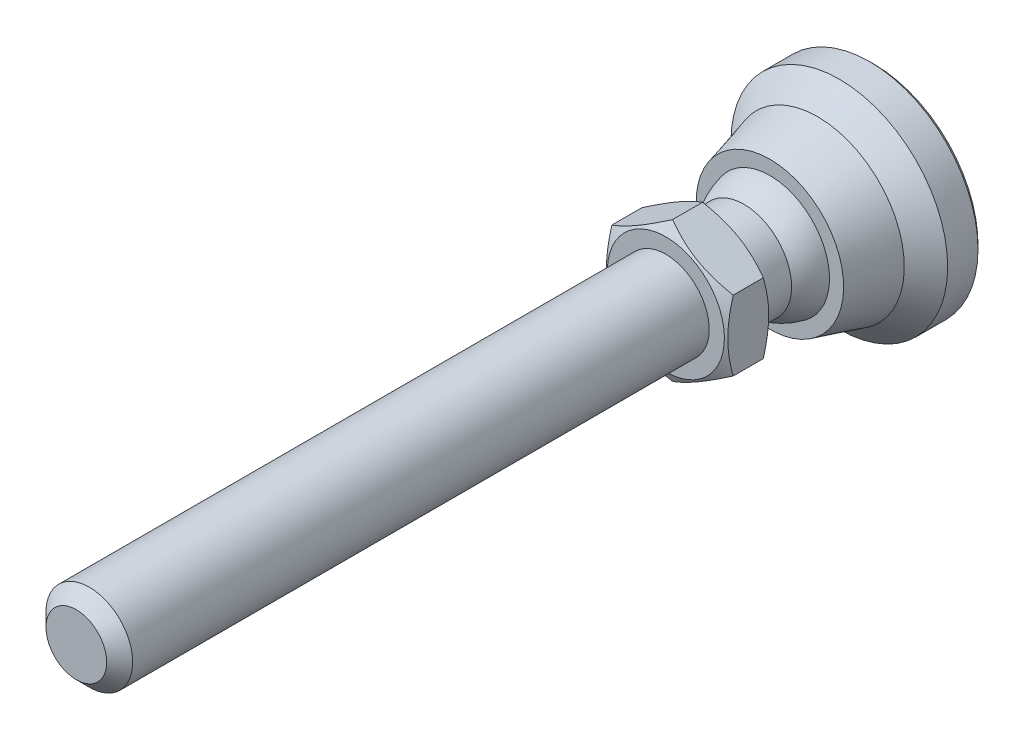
ISO-10303-21;
HEADER;
FILE_DESCRIPTION(('STEP AP214'),'2;1');
FILE_NAME('part.step','',(''),(''),'','','');
FILE_SCHEMA(('AUTOMOTIVE_DESIGN { 1 0 10303 214 1 1 1 1 }'));
ENDSEC;
DATA;
#1=APPLICATION_CONTEXT('core data for automotive mechanical design processes');
#2=APPLICATION_PROTOCOL_DEFINITION('international standard','automotive_design',2000,#1);
#3=PRODUCT_CONTEXT('',#1,'mechanical');
#4=PRODUCT('Part','Part','',(#3));
#5=PRODUCT_RELATED_PRODUCT_CATEGORY('part','',(#4));
#6=PRODUCT_DEFINITION_FORMATION('','',#4);
#7=PRODUCT_DEFINITION_CONTEXT('part definition',#1,'design');
#8=PRODUCT_DEFINITION('design','',#6,#7);
#9=PRODUCT_DEFINITION_SHAPE('','',#8);
#10=(LENGTH_UNIT() NAMED_UNIT(*) SI_UNIT(.MILLI.,.METRE.));
#11=(NAMED_UNIT(*) PLANE_ANGLE_UNIT() SI_UNIT($,.RADIAN.));
#12=(NAMED_UNIT(*) SI_UNIT($,.STERADIAN.) SOLID_ANGLE_UNIT());
#13=UNCERTAINTY_MEASURE_WITH_UNIT(LENGTH_MEASURE(1.E-05),#10,'distance_accuracy_value','');
#14=(GEOMETRIC_REPRESENTATION_CONTEXT(3) GLOBAL_UNCERTAINTY_ASSIGNED_CONTEXT((#13)) GLOBAL_UNIT_ASSIGNED_CONTEXT((#10,
#11,#12)) REPRESENTATION_CONTEXT('',''));
#15=CARTESIAN_POINT('',(0.,0.,0.));
#16=DIRECTION('',(0.,0.,1.));
#17=DIRECTION('',(1.,0.,0.));
#18=AXIS2_PLACEMENT_3D('',#15,#16,#17);
#19=CARTESIAN_POINT('',(-12.,0.,0.));
#20=DIRECTION('',(0.,0.,1.));
#21=DIRECTION('',(0.,-1.,0.));
#22=AXIS2_PLACEMENT_3D('',#19,#20,#21);
#23=PLANE('',#22);
#24=CARTESIAN_POINT('',(0.,0.,0.));
#25=DIRECTION('',(0.,0.,-1.));
#26=DIRECTION('',(0.,1.,0.));
#27=AXIS2_PLACEMENT_3D('',#24,#25,#26);
#28=CIRCLE('',#27,12.);
#29=CARTESIAN_POINT('',(0.,12.,0.));
#30=VERTEX_POINT('',#29);
#31=EDGE_CURVE('E95',#30,#30,#28,.T.);
#32=ORIENTED_EDGE('',*,*,#31,.T.);
#33=EDGE_LOOP('',(#32));
#34=FACE_BOUND('',#33,.T.);
#35=ADVANCED_FACE('F14',(#34),#23,.F.);
#36=CARTESIAN_POINT('',(-5.49999999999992,0.,19.));
#37=DIRECTION('',(0.,0.,1.));
#38=DIRECTION('',(0.,-1.,0.));
#39=AXIS2_PLACEMENT_3D('',#36,#37,#38);
#40=PLANE('',#39);
#41=CARTESIAN_POINT('',(0.,0.,19.));
#42=DIRECTION('',(0.,0.,1.));
#43=DIRECTION('',(0.,-1.,0.));
#44=AXIS2_PLACEMENT_3D('',#41,#42,#43);
#45=CIRCLE('',#44,6.75);
#46=CARTESIAN_POINT('',(0.,-6.75,19.));
#47=VERTEX_POINT('',#46);
#48=EDGE_CURVE('E439',#47,#47,#45,.T.);
#49=ORIENTED_EDGE('',*,*,#48,.F.);
#50=EDGE_LOOP('',(#49));
#51=FACE_BOUND('',#50,.T.);
#52=CARTESIAN_POINT('',(0.,0.,19.));
#53=DIRECTION('',(0.,0.,-1.));
#54=DIRECTION('',(0.,1.,0.));
#55=AXIS2_PLACEMENT_3D('',#52,#53,#54);
#56=CIRCLE('',#55,5.49999999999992);
#57=CARTESIAN_POINT('',(0.,5.49999999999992,19.));
#58=VERTEX_POINT('',#57);
#59=EDGE_CURVE('E116',#58,#58,#56,.T.);
#60=ORIENTED_EDGE('',*,*,#59,.F.);
#61=EDGE_LOOP('',(#60));
#62=FACE_BOUND('',#61,.T.);
#63=ADVANCED_FACE('F142',(#51,#62),#40,.F.);
#64=CARTESIAN_POINT('',(0.,0.,0.));
#65=DIRECTION('',(0.,0.,-1.));
#66=DIRECTION('',(0.,1.,0.));
#67=AXIS2_PLACEMENT_3D('',#64,#65,#66);
#68=CYLINDRICAL_SURFACE('',#67,5.49999999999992);
#69=CARTESIAN_POINT('',(0.,0.,15.));
#70=DIRECTION('',(0.,0.,-1.));
#71=DIRECTION('',(0.,1.,0.));
#72=AXIS2_PLACEMENT_3D('',#69,#70,#71);
#73=CIRCLE('',#72,5.49999999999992);
#74=CARTESIAN_POINT('',(-5.49999999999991,0.,15.));
#75=VERTEX_POINT('',#74);
#76=EDGE_CURVE('E113',#75,#75,#73,.T.);
#77=ORIENTED_EDGE('',*,*,#76,.F.);
#78=EDGE_LOOP('',(#77));
#79=FACE_BOUND('',#78,.T.);
#80=ORIENTED_EDGE('',*,*,#59,.T.);
#81=EDGE_LOOP('',(#80));
#82=FACE_BOUND('',#81,.T.);
#83=ADVANCED_FACE('F148',(#79,#82),#68,.T.);
#84=CARTESIAN_POINT('',(0.,0.,10.6698729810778));
#85=DIRECTION('',(0.,0.,-1.));
#86=DIRECTION('',(-1.,0.,0.));
#87=AXIS2_PLACEMENT_3D('',#84,#85,#86);
#88=SPHERICAL_SURFACE('',#87,7.);
#89=CARTESIAN_POINT('',(0.,0.,12.));
#90=DIRECTION('',(0.,0.,-1.));
#91=DIRECTION('',(0.,1.,0.));
#92=AXIS2_PLACEMENT_3D('',#89,#90,#91);
#93=CIRCLE('',#92,6.87246404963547);
#94=CARTESIAN_POINT('',(-6.87246404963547,0.,12.));
#95=VERTEX_POINT('',#94);
#96=EDGE_CURVE('E110',#95,#95,#93,.T.);
#97=CARTESIAN_POINT('',(-6.87246404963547,0.,12.));
#98=CARTESIAN_POINT('',(-6.8658721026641,0.,12.0340591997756));
#99=CARTESIAN_POINT('',(-6.85902692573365,0.,12.0680693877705));
#100=CARTESIAN_POINT('',(-6.84483171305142,0.,12.1359842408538));
#101=CARTESIAN_POINT('',(-6.83748167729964,0.,12.1698889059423));
#102=CARTESIAN_POINT('',(-6.82227834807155,0.,12.2375852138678));
#103=CARTESIAN_POINT('',(-6.81442505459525,0.,12.2713768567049));
#104=CARTESIAN_POINT('',(-6.79821695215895,0.,12.3388396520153));
#105=CARTESIAN_POINT('',(-6.78986214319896,0.,12.3725108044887));
#106=CARTESIAN_POINT('',(-6.7726528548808,0.,12.4397251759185));
#107=CARTESIAN_POINT('',(-6.76379837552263,0.,12.473268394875));
#108=CARTESIAN_POINT('',(-6.74559170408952,0.,12.5402194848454));
#109=CARTESIAN_POINT('',(-6.73623951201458,0.,12.5736273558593));
#110=CARTESIAN_POINT('',(-6.71703948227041,0.,12.6403003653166));
#111=CARTESIAN_POINT('',(-6.70719164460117,0.,12.67356550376));
#112=CARTESIAN_POINT('',(-6.68700250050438,0.,12.7399456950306));
#113=CARTESIAN_POINT('',(-6.67666119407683,0.,12.7730607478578));
#114=CARTESIAN_POINT('',(-6.65548739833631,0.,12.8391334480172));
#115=CARTESIAN_POINT('',(-6.64465490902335,0.,12.8720910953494));
#116=CARTESIAN_POINT('',(-6.6225011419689,0.,12.9378416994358));
#117=CARTESIAN_POINT('',(-6.61117986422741,0.,12.9706346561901));
#118=CARTESIAN_POINT('',(-6.5880510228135,0.,13.0360486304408));
#119=CARTESIAN_POINT('',(-6.57624345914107,0.,13.0686696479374));
#120=CARTESIAN_POINT('',(-6.55214465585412,0.,13.1337325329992));
#121=CARTESIAN_POINT('',(-6.5398534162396,0.,13.1661744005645));
#122=CARTESIAN_POINT('',(-6.51478997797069,0.,13.2308718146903));
#123=CARTESIAN_POINT('',(-6.5020177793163,0.,13.2631273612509));
#124=CARTESIAN_POINT('',(-6.47599524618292,0.,13.3274450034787));
#125=CARTESIAN_POINT('',(-6.46274491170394,0.,13.3595070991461));
#126=CARTESIAN_POINT('',(-6.4357690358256,0.,13.4234307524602));
#127=CARTESIAN_POINT('',(-6.42204349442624,0.,13.455292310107));
#128=CARTESIAN_POINT('',(-6.39412023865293,0.,13.5188078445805));
#129=CARTESIAN_POINT('',(-6.37992252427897,0.,13.5504618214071));
#130=CARTESIAN_POINT('',(-6.35105806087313,0.,13.6135551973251));
#131=CARTESIAN_POINT('',(-6.33639131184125,0.,13.6449945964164));
#132=CARTESIAN_POINT('',(-6.30659202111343,0.,13.7076518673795));
#133=CARTESIAN_POINT('',(-6.29145947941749,0.,13.7388697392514));
#134=CARTESIAN_POINT('',(-6.26073194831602,0.,13.8010770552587));
#135=CARTESIAN_POINT('',(-6.24513695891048,0.,13.8320664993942));
#136=CARTESIAN_POINT('',(-6.21348797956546,0.,13.8938101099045));
#137=CARTESIAN_POINT('',(-6.19743398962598,0.,13.9245642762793));
#138=CARTESIAN_POINT('',(-6.16487055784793,0.,13.9858305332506));
#139=CARTESIAN_POINT('',(-6.14836111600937,0.,14.016342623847));
#140=CARTESIAN_POINT('',(-6.11489042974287,0.,14.0771179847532));
#141=CARTESIAN_POINT('',(-6.09792918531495,0.,14.107381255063));
#142=CARTESIAN_POINT('',(-6.06355864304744,0.,14.1676522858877));
#143=CARTESIAN_POINT('',(-6.04614934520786,0.,14.1976600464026));
#144=CARTESIAN_POINT('',(-6.01088654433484,0.,14.2574134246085));
#145=CARTESIAN_POINT('',(-5.99303304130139,0.,14.2871590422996));
#146=CARTESIAN_POINT('',(-5.9568857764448,0.,14.3463815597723));
#147=CARTESIAN_POINT('',(-5.93859201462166,0.,14.3758584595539));
#148=CARTESIAN_POINT('',(-5.90156827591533,0.,14.4345370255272));
#149=CARTESIAN_POINT('',(-5.88283829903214,0.,14.4637386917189));
#150=CARTESIAN_POINT('',(-5.84494627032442,0.,14.5218603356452));
#151=CARTESIAN_POINT('',(-5.82578421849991,0.,14.5507803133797));
#152=CARTESIAN_POINT('',(-5.78703227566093,0.,14.6083321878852));
#153=CARTESIAN_POINT('',(-5.76744238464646,0.,14.6369640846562));
#154=CARTESIAN_POINT('',(-5.72783909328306,0.,14.6939334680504));
#155=CARTESIAN_POINT('',(-5.70782569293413,0.,14.7222709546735));
#156=CARTESIAN_POINT('',(-5.66737980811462,0.,14.778645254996));
#157=CARTESIAN_POINT('',(-5.64694732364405,0.,14.8066820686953));
#158=CARTESIAN_POINT('',(-5.60566778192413,0.,14.862448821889));
#159=CARTESIAN_POINT('',(-5.58482072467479,0.,14.8901787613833));
#160=CARTESIAN_POINT('',(-5.54271666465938,0.,14.9453256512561));
#161=CARTESIAN_POINT('',(-5.52145966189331,0.,14.9727426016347));
#162=CARTESIAN_POINT('',(-5.49999999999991,0.,15.));
#163=B_SPLINE_CURVE_WITH_KNOTS('',3,(#97,#98,#99,#100,#101,#102,#103,#104,#105,#106,#107,#108,
#109,#110,#111,#112,#113,#114,#115,#116,#117,#118,#119,#120,#121,#122,#123,#124,#125,#126,#127,
#128,#129,#130,#131,#132,#133,#134,#135,#136,#137,#138,#139,#140,#141,#142,#143,#144,#145,#146,
#147,#148,#149,#150,#151,#152,#153,#154,#155,#156,#157,#158,#159,#160,#161,#162),.UNSPECIFIED.,
.F.,.F.,(4,2,2,2,2,2,2,2,2,2,2,2,2,2,2,2,2,2,2,2,2,2,2,2,2,2,2,2,2,2,2,2,4),(0.,
0.104072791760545,0.208145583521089,0.312218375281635,0.416291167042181,0.520363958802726,
0.62443675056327,0.728509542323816,0.83258233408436,0.936655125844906,1.04072791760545,
1.144800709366,1.24887350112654,1.35294629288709,1.45701908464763,1.56109187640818,
1.66516466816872,1.76923745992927,1.87331025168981,1.97738304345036,2.0814558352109,
2.18552862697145,2.28960141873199,2.39367421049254,2.49774700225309,2.60181979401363,
2.70589258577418,2.80996537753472,2.91403816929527,3.01811096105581,3.12218375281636,
3.2262565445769,3.33032933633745),.UNSPECIFIED.);
#164=EDGE_CURVE('BSEAM179',#95,#75,#163,.T.);
#165=ORIENTED_EDGE('',*,*,#96,.F.);
#166=ORIENTED_EDGE('',*,*,#76,.T.);
#167=ORIENTED_EDGE('',*,*,#164,.T.);
#168=ORIENTED_EDGE('',*,*,#164,.F.);
#169=EDGE_LOOP('',(#165,#167,#166,#168));
#170=FACE_BOUND('',#169,.T.);
#171=ADVANCED_FACE('F179',(#170),#88,.T.);
#172=CARTESIAN_POINT('',(-8.5,0.,12.));
#173=DIRECTION('',(0.,0.,-1.));
#174=DIRECTION('',(0.,1.,0.));
#175=AXIS2_PLACEMENT_3D('',#172,#173,#174);
#176=PLANE('',#175);
#177=CARTESIAN_POINT('',(0.,0.,12.));
#178=DIRECTION('',(0.,0.,-1.));
#179=DIRECTION('',(0.,1.,0.));
#180=AXIS2_PLACEMENT_3D('',#177,#178,#179);
#181=CIRCLE('',#180,8.5);
#182=CARTESIAN_POINT('',(0.,8.5,12.));
#183=VERTEX_POINT('',#182);
#184=EDGE_CURVE('E107',#183,#183,#181,.T.);
#185=ORIENTED_EDGE('',*,*,#184,.F.);
#186=EDGE_LOOP('',(#185));
#187=FACE_BOUND('',#186,.T.);
#188=ORIENTED_EDGE('',*,*,#96,.T.);
#189=EDGE_LOOP('',(#188));
#190=FACE_BOUND('',#189,.T.);
#191=ADVANCED_FACE('F173',(#187,#190),#176,.F.);
#192=CARTESIAN_POINT('',(0.,0.,12.));
#193=DIRECTION('',(0.,0.,-1.));
#194=DIRECTION('',(0.,1.,0.));
#195=AXIS2_PLACEMENT_3D('',#192,#193,#194);
#196=CONICAL_SURFACE('',#195,8.5,0.266252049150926);
#197=CARTESIAN_POINT('',(0.,0.,6.5));
#198=DIRECTION('',(0.,0.,-1.));
#199=DIRECTION('',(0.,1.,0.));
#200=AXIS2_PLACEMENT_3D('',#197,#198,#199);
#201=CIRCLE('',#200,10.);
#202=CARTESIAN_POINT('',(0.,10.,6.5));
#203=VERTEX_POINT('',#202);
#204=EDGE_CURVE('E104',#203,#203,#201,.T.);
#205=ORIENTED_EDGE('',*,*,#204,.F.);
#206=EDGE_LOOP('',(#205));
#207=FACE_BOUND('',#206,.T.);
#208=ORIENTED_EDGE('',*,*,#184,.T.);
#209=EDGE_LOOP('',(#208));
#210=FACE_BOUND('',#209,.T.);
#211=ADVANCED_FACE('F167',(#207,#210),#196,.T.);
#212=CARTESIAN_POINT('',(0.,0.,6.5));
#213=DIRECTION('',(0.,0.,-1.));
#214=DIRECTION('',(0.,1.,0.));
#215=AXIS2_PLACEMENT_3D('',#212,#213,#214);
#216=CONICAL_SURFACE('',#215,10.,0.785398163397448);
#217=CARTESIAN_POINT('',(0.,0.,4.));
#218=DIRECTION('',(0.,0.,-1.));
#219=DIRECTION('',(0.,1.,0.));
#220=AXIS2_PLACEMENT_3D('',#217,#218,#219);
#221=CIRCLE('',#220,12.5);
#222=CARTESIAN_POINT('',(0.,12.5,4.));
#223=VERTEX_POINT('',#222);
#224=EDGE_CURVE('E101',#223,#223,#221,.T.);
#225=ORIENTED_EDGE('',*,*,#224,.F.);
#226=EDGE_LOOP('',(#225));
#227=FACE_BOUND('',#226,.T.);
#228=ORIENTED_EDGE('',*,*,#204,.T.);
#229=EDGE_LOOP('',(#228));
#230=FACE_BOUND('',#229,.T.);
#231=ADVANCED_FACE('F161',(#227,#230),#216,.T.);
#232=CARTESIAN_POINT('',(0.,0.,0.));
#233=DIRECTION('',(0.,0.,-1.));
#234=DIRECTION('',(0.,1.,0.));
#235=AXIS2_PLACEMENT_3D('',#232,#233,#234);
#236=CYLINDRICAL_SURFACE('',#235,12.5);
#237=CARTESIAN_POINT('',(0.,0.,0.5));
#238=DIRECTION('',(0.,0.,-1.));
#239=DIRECTION('',(0.,1.,0.));
#240=AXIS2_PLACEMENT_3D('',#237,#238,#239);
#241=CIRCLE('',#240,12.5);
#242=CARTESIAN_POINT('',(0.,12.5,0.5));
#243=VERTEX_POINT('',#242);
#244=EDGE_CURVE('E98',#243,#243,#241,.T.);
#245=ORIENTED_EDGE('',*,*,#244,.F.);
#246=EDGE_LOOP('',(#245));
#247=FACE_BOUND('',#246,.T.);
#248=ORIENTED_EDGE('',*,*,#224,.T.);
#249=EDGE_LOOP('',(#248));
#250=FACE_BOUND('',#249,.T.);
#251=ADVANCED_FACE('F155',(#247,#250),#236,.T.);
#252=CARTESIAN_POINT('',(0.,0.,0.5));
#253=DIRECTION('',(0.,0.,1.));
#254=DIRECTION('',(0.,-1.,0.));
#255=AXIS2_PLACEMENT_3D('',#252,#253,#254);
#256=CONICAL_SURFACE('',#255,12.5,0.785398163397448);
#257=ORIENTED_EDGE('',*,*,#31,.F.);
#258=EDGE_LOOP('',(#257));
#259=FACE_BOUND('',#258,.T.);
#260=ORIENTED_EDGE('',*,*,#244,.T.);
#261=EDGE_LOOP('',(#260));
#262=FACE_BOUND('',#261,.T.);
#263=ADVANCED_FACE('F140',(#259,#262),#256,.T.);
#264=CARTESIAN_POINT('',(0.,0.,19.));
#265=DIRECTION('',(0.,0.,1.));
#266=DIRECTION('',(0.,-1.,0.));
#267=AXIS2_PLACEMENT_3D('',#264,#265,#266);
#268=CONICAL_SURFACE('',#267,6.75,1.0471975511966);
#269=CARTESIAN_POINT('',(0.000200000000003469,-8.0830192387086,19.7696190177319));
#270=CARTESIAN_POINT('',(-0.15366790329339,-7.99418356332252,19.7183374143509));
#271=CARTESIAN_POINT('',(-0.30810950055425,-7.90501666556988,19.669383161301));
#272=CARTESIAN_POINT('',(-0.618246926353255,-7.72595873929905,19.5767703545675));
#273=CARTESIAN_POINT('',(-0.773943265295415,-7.63606741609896,19.5331140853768));
#274=CARTESIAN_POINT('',(-1.24352516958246,-7.36495417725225,19.4109491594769));
#275=CARTESIAN_POINT('',(-1.5592643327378,-7.18266208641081,19.3414631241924));
#276=CARTESIAN_POINT('',(-2.03176224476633,-6.90986528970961,19.2599825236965));
#277=CARTESIAN_POINT('',(-2.18710922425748,-6.82017566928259,19.2367710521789));
#278=CARTESIAN_POINT('',(-2.49850511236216,-6.64039116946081,19.1978487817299));
#279=CARTESIAN_POINT('',(-2.65455395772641,-6.55029632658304,19.1821373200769));
#280=CARTESIAN_POINT('',(-2.96692267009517,-6.36995016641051,19.1586154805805));
#281=CARTESIAN_POINT('',(-3.12324202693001,-6.27969914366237,19.1507961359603));
#282=CARTESIAN_POINT('',(-3.43601650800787,-6.09911871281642,19.1432178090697));
#283=CARTESIAN_POINT('',(-3.59247162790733,-6.00878930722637,19.1434585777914));
#284=CARTESIAN_POINT('',(-4.02110687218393,-5.76131663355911,19.155197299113));
#285=CARTESIAN_POINT('',(-4.2931466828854,-5.60425437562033,19.1749033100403));
#286=CARTESIAN_POINT('',(-4.83541944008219,-5.29117305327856,19.2373910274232));
#287=CARTESIAN_POINT('',(-5.10565047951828,-5.13515508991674,19.2801940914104));
#288=CARTESIAN_POINT('',(-5.64901454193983,-4.82144370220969,19.3871892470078));
#289=CARTESIAN_POINT('',(-5.92207900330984,-4.6637898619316,19.4518346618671));
#290=CARTESIAN_POINT('',(-6.46413578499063,-4.35083323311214,19.5985536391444));
#291=CARTESIAN_POINT('',(-6.73313504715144,-4.19552643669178,19.680592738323));
#292=CARTESIAN_POINT('',(-7.0002,-4.04133641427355,19.7696190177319));
#293=B_SPLINE_CURVE_WITH_KNOTS('',3,(#269,#270,#271,#272,#273,#274,#275,#276,#277,#278,#279,
#280,#281,#282,#283,#284,#285,#286,#287,#288,#289,#290,#291,#292),.UNSPECIFIED.,.F.,.F.,(4,2,2,
2,2,2,2,2,2,2,2,4),(0.,0.554727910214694,1.10969417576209,2.2219327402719,2.76443041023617,
3.30688013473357,3.8487128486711,4.39052882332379,5.33376515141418,6.27787517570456,
7.24292418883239,8.20607866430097),.UNSPECIFIED.);
#294=CARTESIAN_POINT('',(0.,-8.08290376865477,19.7695523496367));
#295=VERTEX_POINT('',#294);
#296=CARTESIAN_POINT('',(-7.,-4.04145188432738,19.7695523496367));
#297=VERTEX_POINT('',#296);
#298=EDGE_CURVE('E72',#295,#297,#293,.T.);
#299=ORIENTED_EDGE('',*,*,#298,.T.);
#300=CARTESIAN_POINT('',(-7.,10.8137714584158,22.5401265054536));
#301=CARTESIAN_POINT('',(-7.,10.5083844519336,22.3921560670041));
#302=CARTESIAN_POINT('',(-7.,10.2022918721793,22.2456166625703));
#303=CARTESIAN_POINT('',(-7.,9.58832016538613,21.9562056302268));
#304=CARTESIAN_POINT('',(-7.,9.28044076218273,21.8133345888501));
#305=CARTESIAN_POINT('',(-7.,8.66091345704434,21.5313381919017));
#306=CARTESIAN_POINT('',(-7.,8.34925413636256,21.392237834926));
#307=CARTESIAN_POINT('',(-7.,7.7234419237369,21.1197861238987));
#308=CARTESIAN_POINT('',(-7.,7.4092891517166,20.9864344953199));
#309=CARTESIAN_POINT('',(-7.,6.76801597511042,20.7229005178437));
#310=CARTESIAN_POINT('',(-7.,6.44079929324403,20.5929511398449));
#311=CARTESIAN_POINT('',(-7.,5.7825230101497,20.3429896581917));
#312=CARTESIAN_POINT('',(-7.,5.45146298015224,20.2229786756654));
#313=CARTESIAN_POINT('',(-7.,4.78560265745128,19.9960757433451));
#314=CARTESIAN_POINT('',(-7.,4.45081164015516,19.8891568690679));
#315=CARTESIAN_POINT('',(-7.,3.77643973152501,19.6918952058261));
#316=CARTESIAN_POINT('',(-7.,3.43686039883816,19.6015471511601));
#317=CARTESIAN_POINT('',(-7.,2.75453763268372,19.4422746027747));
#318=CARTESIAN_POINT('',(-7.,2.41182167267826,19.3732356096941));
#319=CARTESIAN_POINT('',(-7.,1.89466079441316,19.2886690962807));
#320=CARTESIAN_POINT('',(-7.,1.7217463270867,19.263644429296));
#321=CARTESIAN_POINT('',(-7.,1.37507230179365,19.2204175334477));
#322=CARTESIAN_POINT('',(-7.,1.20131282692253,19.202214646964));
#323=CARTESIAN_POINT('',(-7.,0.855433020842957,19.1732200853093));
#324=CARTESIAN_POINT('',(-7.,0.68332048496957,19.1623357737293));
#325=CARTESIAN_POINT('',(-7.,0.338789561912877,19.1478522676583));
#326=CARTESIAN_POINT('',(-7.,0.166371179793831,19.1442529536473));
#327=CARTESIAN_POINT('',(-7.,-0.178463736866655,19.1444251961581));
#328=CARTESIAN_POINT('',(-7.,-0.350880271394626,19.1481967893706));
#329=CARTESIAN_POINT('',(-7.,-0.695402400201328,19.1630194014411));
#330=CARTESIAN_POINT('',(-7.,-0.867507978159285,19.1740707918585));
#331=CARTESIAN_POINT('',(-7.,-1.28241320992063,19.2092557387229));
#332=CARTESIAN_POINT('',(-7.,-1.5249200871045,19.236914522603));
#333=CARTESIAN_POINT('',(-7.,-2.00809479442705,19.3051668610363));
#334=CARTESIAN_POINT('',(-7.,-2.24876236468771,19.3457622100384));
#335=CARTESIAN_POINT('',(-7.,-2.96775292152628,19.4847971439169));
#336=CARTESIAN_POINT('',(-7.,-3.4427873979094,19.6004591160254));
#337=CARTESIAN_POINT('',(-7.,-4.15303686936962,19.8005348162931));
#338=CARTESIAN_POINT('',(-7.,-4.39194821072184,19.872577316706));
#339=CARTESIAN_POINT('',(-7.,-4.8674495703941,20.0240221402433));
#340=CARTESIAN_POINT('',(-7.,-5.10403957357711,20.103424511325));
#341=CARTESIAN_POINT('',(-7.,-5.57497507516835,20.2683253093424));
#342=CARTESIAN_POINT('',(-7.,-5.80932131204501,20.3538216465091));
#343=CARTESIAN_POINT('',(-7.,-6.27608043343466,20.5299166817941));
#344=CARTESIAN_POINT('',(-7.,-6.50849333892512,20.6205153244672));
#345=CARTESIAN_POINT('',(-7.,-7.05012187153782,20.8374086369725));
#346=CARTESIAN_POINT('',(-7.,-7.35866025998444,20.9653912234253));
#347=CARTESIAN_POINT('',(-7.,-7.97317276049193,21.2273884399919));
#348=CARTESIAN_POINT('',(-7.,-8.2791467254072,21.3614034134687));
#349=CARTESIAN_POINT('',(-7.,-8.88899309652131,21.6342731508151));
#350=CARTESIAN_POINT('',(-7.,-9.19286509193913,21.7731288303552));
#351=CARTESIAN_POINT('',(-7.,-9.79880590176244,22.0547271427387));
#352=CARTESIAN_POINT('',(-7.,-10.1008746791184,22.1974698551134));
#353=CARTESIAN_POINT('',(-7.,-10.7038018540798,22.4862682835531));
#354=CARTESIAN_POINT('',(-7.,-11.0046586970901,22.6323272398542));
#355=CARTESIAN_POINT('',(-7.,-11.6050892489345,22.9270615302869));
#356=CARTESIAN_POINT('',(-7.,-11.9046629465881,23.0757368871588));
#357=CARTESIAN_POINT('',(-7.,-12.801686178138,23.5249639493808));
#358=CARTESIAN_POINT('',(-7.,-13.3975140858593,23.8287534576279));
#359=CARTESIAN_POINT('',(-7.,-14.5373099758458,24.4172863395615));
#360=CARTESIAN_POINT('',(-7.,-15.0815265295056,24.7015504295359));
#361=CARTESIAN_POINT('',(-7.,-16.1679321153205,25.2739677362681));
#362=CARTESIAN_POINT('',(-7.,-16.7101210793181,25.5621210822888));
#363=CARTESIAN_POINT('',(-7.,-17.7916149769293,26.1407027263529));
#364=CARTESIAN_POINT('',(-7.,-18.3309237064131,26.4311239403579));
#365=CARTESIAN_POINT('',(-7.,-19.4082408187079,27.0143013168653));
#366=CARTESIAN_POINT('',(-7.,-19.9462492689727,27.3070573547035));
#367=CARTESIAN_POINT('',(-7.,-20.4837771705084,27.6006871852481));
#368=B_SPLINE_CURVE_WITH_KNOTS('',3,(#300,#301,#302,#303,#304,#305,#306,#307,#308,#309,#310,
#311,#312,#313,#314,#315,#316,#317,#318,#319,#320,#321,#322,#323,#324,#325,#326,#327,#328,#329,
#330,#331,#332,#333,#334,#335,#336,#337,#338,#339,#340,#341,#342,#343,#344,#345,#346,#347,#348,
#349,#350,#351,#352,#353,#354,#355,#356,#357,#358,#359,#360,#361,#362,#363,#364,#365,#366,#367),
.UNSPECIFIED.,.F.,.F.,(4,2,2,2,2,2,2,2,2,2,2,2,2,2,2,2,2,2,2,2,2,2,2,2,2,2,2,2,2,2,2,2,2,4),(0.,
1.01805402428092,2.03626982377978,3.06010025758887,4.08388174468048,5.13998488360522,
6.19620699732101,7.25021910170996,8.30389569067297,9.35180785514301,9.8758421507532,
10.3998259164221,10.9170456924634,11.4342569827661,11.9514708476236,12.4687111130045,
13.2005339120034,13.9324582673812,15.3971361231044,16.1456864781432,16.8942417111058,
17.6425414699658,18.3908330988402,19.392834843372,20.3948936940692,21.3971431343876,
22.3994130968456,23.4027085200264,24.4060126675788,26.412367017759,28.2543055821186,
30.0963055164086,31.9339025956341,33.7714022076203),.UNSPECIFIED.);
#369=CARTESIAN_POINT('',(-7.,4.04145188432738,19.7695523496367));
#370=VERTEX_POINT('',#369);
#371=EDGE_CURVE('E80',#297,#370,#368,.F.);
#372=ORIENTED_EDGE('',*,*,#371,.T.);
#373=CARTESIAN_POINT('',(-7.0002,4.04133641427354,19.7696190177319));
#374=CARTESIAN_POINT('',(-6.84633209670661,4.13017208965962,19.7183374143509));
#375=CARTESIAN_POINT('',(-6.69189049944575,4.21933898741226,19.669383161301));
#376=CARTESIAN_POINT('',(-6.38175307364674,4.39839691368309,19.5767703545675));
#377=CARTESIAN_POINT('',(-6.22605673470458,4.48828823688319,19.5331140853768));
#378=CARTESIAN_POINT('',(-5.75647483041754,4.75940147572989,19.4109491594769));
#379=CARTESIAN_POINT('',(-5.4407356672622,4.94169356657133,19.3414631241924));
#380=CARTESIAN_POINT('',(-4.96823775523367,5.21449036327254,19.2599825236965));
#381=CARTESIAN_POINT('',(-4.81289077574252,5.30417998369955,19.2367710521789));
#382=CARTESIAN_POINT('',(-4.50149488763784,5.48396448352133,19.1978487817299));
#383=CARTESIAN_POINT('',(-4.34544604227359,5.57405932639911,19.1821373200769));
#384=CARTESIAN_POINT('',(-4.03307732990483,5.75440548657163,19.1586154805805));
#385=CARTESIAN_POINT('',(-3.87675797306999,5.84465650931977,19.1507961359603));
#386=CARTESIAN_POINT('',(-3.56398349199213,6.02523694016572,19.1432178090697));
#387=CARTESIAN_POINT('',(-3.40752837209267,6.11556634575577,19.1434585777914));
#388=CARTESIAN_POINT('',(-2.97889312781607,6.36303901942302,19.155197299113));
#389=CARTESIAN_POINT('',(-2.7068533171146,6.52010127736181,19.1749033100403));
#390=CARTESIAN_POINT('',(-2.16458055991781,6.83318259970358,19.2373910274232));
#391=CARTESIAN_POINT('',(-1.89434952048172,6.9892005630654,19.2801940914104));
#392=CARTESIAN_POINT('',(-1.35098545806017,7.30291195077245,19.3871892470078));
#393=CARTESIAN_POINT('',(-1.07792099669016,7.46056579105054,19.4518346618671));
#394=CARTESIAN_POINT('',(-0.535864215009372,7.77352241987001,19.5985536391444));
#395=CARTESIAN_POINT('',(-0.266864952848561,7.92882921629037,19.680592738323));
#396=CARTESIAN_POINT('',(0.000199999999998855,8.0830192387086,19.7696190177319));
#397=B_SPLINE_CURVE_WITH_KNOTS('',3,(#373,#374,#375,#376,#377,#378,#379,#380,#381,#382,#383,
#384,#385,#386,#387,#388,#389,#390,#391,#392,#393,#394,#395,#396),.UNSPECIFIED.,.F.,.F.,(4,2,2,
2,2,2,2,2,2,2,2,4),(0.,0.554727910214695,1.10969417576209,2.2219327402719,2.76443041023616,
3.30688013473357,3.84871284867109,4.39052882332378,5.33376515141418,6.27787517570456,
7.2429241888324,8.20607866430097),.UNSPECIFIED.);
#398=CARTESIAN_POINT('',(0.,8.08290376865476,19.7695523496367));
#399=VERTEX_POINT('',#398);
#400=EDGE_CURVE('E394',#370,#399,#397,.T.);
#401=ORIENTED_EDGE('',*,*,#400,.T.);
#402=CARTESIAN_POINT('',(-0.000200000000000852,8.0830192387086,19.7696190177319));
#403=CARTESIAN_POINT('',(0.153667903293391,7.99418356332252,19.7183374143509));
#404=CARTESIAN_POINT('',(0.30810950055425,7.90501666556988,19.669383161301));
#405=CARTESIAN_POINT('',(0.618246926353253,7.72595873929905,19.5767703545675));
#406=CARTESIAN_POINT('',(0.773943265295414,7.63606741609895,19.5331140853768));
#407=CARTESIAN_POINT('',(1.24352516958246,7.36495417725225,19.4109491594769));
#408=CARTESIAN_POINT('',(1.5592643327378,7.18266208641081,19.3414631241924));
#409=CARTESIAN_POINT('',(2.03176224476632,6.9098652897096,19.2599825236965));
#410=CARTESIAN_POINT('',(2.18710922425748,6.82017566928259,19.2367710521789));
#411=CARTESIAN_POINT('',(2.49850511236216,6.64039116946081,19.1978487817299));
#412=CARTESIAN_POINT('',(2.6545539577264,6.55029632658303,19.1821373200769));
#413=CARTESIAN_POINT('',(2.96692267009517,6.36995016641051,19.1586154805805));
#414=CARTESIAN_POINT('',(3.12324202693,6.27969914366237,19.1507961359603));
#415=CARTESIAN_POINT('',(3.43601650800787,6.09911871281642,19.1432178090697));
#416=CARTESIAN_POINT('',(3.59247162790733,6.00878930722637,19.1434585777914));
#417=CARTESIAN_POINT('',(4.02110687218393,5.76131663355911,19.155197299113));
#418=CARTESIAN_POINT('',(4.29314668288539,5.60425437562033,19.1749033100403));
#419=CARTESIAN_POINT('',(4.83541944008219,5.29117305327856,19.2373910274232));
#420=CARTESIAN_POINT('',(5.10565047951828,5.13515508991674,19.2801940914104));
#421=CARTESIAN_POINT('',(5.64901454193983,4.82144370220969,19.3871892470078));
#422=CARTESIAN_POINT('',(5.92207900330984,4.66378986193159,19.4518346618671));
#423=CARTESIAN_POINT('',(6.46413578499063,4.35083323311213,19.5985536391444));
#424=CARTESIAN_POINT('',(6.73313504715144,4.19552643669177,19.680592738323));
#425=CARTESIAN_POINT('',(7.0002,4.04133641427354,19.7696190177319));
#426=B_SPLINE_CURVE_WITH_KNOTS('',3,(#402,#403,#404,#405,#406,#407,#408,#409,#410,#411,#412,
#413,#414,#415,#416,#417,#418,#419,#420,#421,#422,#423,#424,#425),.UNSPECIFIED.,.F.,.F.,(4,2,2,
2,2,2,2,2,2,2,2,4),(0.,0.554727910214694,1.10969417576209,2.22193274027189,2.76443041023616,
3.30688013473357,3.84871284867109,4.39052882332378,5.33376515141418,6.27787517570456,
7.2429241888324,8.20607866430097),.UNSPECIFIED.);
#427=CARTESIAN_POINT('',(7.,4.04145188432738,19.7695523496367));
#428=VERTEX_POINT('',#427);
#429=EDGE_CURVE('E389',#399,#428,#426,.T.);
#430=ORIENTED_EDGE('',*,*,#429,.T.);
#431=CARTESIAN_POINT('',(7.,10.8137714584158,22.5401265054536));
#432=CARTESIAN_POINT('',(7.,10.5083844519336,22.3921560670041));
#433=CARTESIAN_POINT('',(7.,10.2022918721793,22.2456166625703));
#434=CARTESIAN_POINT('',(7.,9.58832016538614,21.9562056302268));
#435=CARTESIAN_POINT('',(7.,9.28044076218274,21.8133345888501));
#436=CARTESIAN_POINT('',(7.,8.66091345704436,21.5313381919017));
#437=CARTESIAN_POINT('',(7.,8.34925413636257,21.392237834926));
#438=CARTESIAN_POINT('',(7.,7.72344192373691,21.1197861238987));
#439=CARTESIAN_POINT('',(7.,7.40928915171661,20.9864344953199));
#440=CARTESIAN_POINT('',(7.,6.76801597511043,20.7229005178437));
#441=CARTESIAN_POINT('',(7.,6.44079929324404,20.5929511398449));
#442=CARTESIAN_POINT('',(7.,5.78252301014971,20.3429896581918));
#443=CARTESIAN_POINT('',(7.,5.45146298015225,20.2229786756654));
#444=CARTESIAN_POINT('',(7.,4.78560265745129,19.9960757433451));
#445=CARTESIAN_POINT('',(7.,4.45081164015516,19.8891568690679));
#446=CARTESIAN_POINT('',(7.,3.77643973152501,19.6918952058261));
#447=CARTESIAN_POINT('',(7.,3.43686039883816,19.6015471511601));
#448=CARTESIAN_POINT('',(7.,2.75453763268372,19.4422746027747));
#449=CARTESIAN_POINT('',(7.,2.41182167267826,19.3732356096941));
#450=CARTESIAN_POINT('',(7.,1.89466079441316,19.2886690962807));
#451=CARTESIAN_POINT('',(7.,1.7217463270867,19.263644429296));
#452=CARTESIAN_POINT('',(7.,1.37507230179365,19.2204175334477));
#453=CARTESIAN_POINT('',(7.,1.20131282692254,19.202214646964));
#454=CARTESIAN_POINT('',(7.,0.855433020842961,19.1732200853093));
#455=CARTESIAN_POINT('',(7.,0.683320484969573,19.1623357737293));
#456=CARTESIAN_POINT('',(7.,0.338789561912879,19.1478522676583));
#457=CARTESIAN_POINT('',(7.,0.166371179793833,19.1442529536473));
#458=CARTESIAN_POINT('',(7.,-0.178463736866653,19.1444251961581));
#459=CARTESIAN_POINT('',(7.,-0.350880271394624,19.1481967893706));
#460=CARTESIAN_POINT('',(7.,-0.695402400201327,19.1630194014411));
#461=CARTESIAN_POINT('',(7.,-0.867507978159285,19.1740707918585));
#462=CARTESIAN_POINT('',(7.,-1.28241320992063,19.2092557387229));
#463=CARTESIAN_POINT('',(7.,-1.5249200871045,19.236914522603));
#464=CARTESIAN_POINT('',(7.,-2.00809479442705,19.3051668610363));
#465=CARTESIAN_POINT('',(7.,-2.24876236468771,19.3457622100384));
#466=CARTESIAN_POINT('',(7.,-2.96775292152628,19.4847971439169));
#467=CARTESIAN_POINT('',(7.,-3.4427873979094,19.6004591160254));
#468=CARTESIAN_POINT('',(7.,-4.15303686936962,19.8005348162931));
#469=CARTESIAN_POINT('',(7.,-4.39194821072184,19.872577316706));
#470=CARTESIAN_POINT('',(7.,-4.8674495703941,20.0240221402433));
#471=CARTESIAN_POINT('',(7.,-5.10403957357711,20.103424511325));
#472=CARTESIAN_POINT('',(7.,-5.57497507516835,20.2683253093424));
#473=CARTESIAN_POINT('',(7.,-5.80932131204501,20.3538216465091));
#474=CARTESIAN_POINT('',(7.,-6.27608043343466,20.5299166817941));
#475=CARTESIAN_POINT('',(7.,-6.50849333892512,20.6205153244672));
#476=CARTESIAN_POINT('',(7.,-7.05012187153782,20.8374086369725));
#477=CARTESIAN_POINT('',(7.,-7.35866025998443,20.9653912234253));
#478=CARTESIAN_POINT('',(7.,-7.97317276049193,21.2273884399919));
#479=CARTESIAN_POINT('',(7.,-8.27914672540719,21.3614034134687));
#480=CARTESIAN_POINT('',(7.,-8.88899309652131,21.6342731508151));
#481=CARTESIAN_POINT('',(7.,-9.19286509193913,21.7731288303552));
#482=CARTESIAN_POINT('',(7.,-9.79880590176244,22.0547271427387));
#483=CARTESIAN_POINT('',(7.,-10.1008746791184,22.1974698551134));
#484=CARTESIAN_POINT('',(7.,-10.7038018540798,22.4862682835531));
#485=CARTESIAN_POINT('',(7.,-11.0046586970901,22.6323272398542));
#486=CARTESIAN_POINT('',(7.,-11.6050892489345,22.9270615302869));
#487=CARTESIAN_POINT('',(7.,-11.9046629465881,23.0757368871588));
#488=CARTESIAN_POINT('',(7.,-12.801686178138,23.5249639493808));
#489=CARTESIAN_POINT('',(7.,-13.3975140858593,23.8287534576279));
#490=CARTESIAN_POINT('',(7.,-14.5373099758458,24.4172863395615));
#491=CARTESIAN_POINT('',(7.,-15.0815265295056,24.7015504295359));
#492=CARTESIAN_POINT('',(7.,-16.1679321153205,25.2739677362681));
#493=CARTESIAN_POINT('',(7.,-16.7101210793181,25.5621210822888));
#494=CARTESIAN_POINT('',(7.,-17.7916149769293,26.1407027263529));
#495=CARTESIAN_POINT('',(7.,-18.3309237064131,26.4311239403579));
#496=CARTESIAN_POINT('',(7.,-19.4082408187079,27.0143013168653));
#497=CARTESIAN_POINT('',(7.,-19.9462492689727,27.3070573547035));
#498=CARTESIAN_POINT('',(7.,-20.4837771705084,27.6006871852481));
#499=B_SPLINE_CURVE_WITH_KNOTS('',3,(#431,#432,#433,#434,#435,#436,#437,#438,#439,#440,#441,
#442,#443,#444,#445,#446,#447,#448,#449,#450,#451,#452,#453,#454,#455,#456,#457,#458,#459,#460,
#461,#462,#463,#464,#465,#466,#467,#468,#469,#470,#471,#472,#473,#474,#475,#476,#477,#478,#479,
#480,#481,#482,#483,#484,#485,#486,#487,#488,#489,#490,#491,#492,#493,#494,#495,#496,#497,#498),
.UNSPECIFIED.,.F.,.F.,(4,2,2,2,2,2,2,2,2,2,2,2,2,2,2,2,2,2,2,2,2,2,2,2,2,2,2,2,2,2,2,2,2,4),(0.,
1.01805402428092,2.03626982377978,3.06010025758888,4.08388174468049,5.13998488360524,
6.19620699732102,7.25021910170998,8.30389569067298,9.35180785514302,9.87584215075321,
10.3998259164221,10.9170456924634,11.4342569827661,11.9514708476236,12.4687111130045,
13.2005339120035,13.9324582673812,15.3971361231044,16.1456864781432,16.8942417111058,
17.6425414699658,18.3908330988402,19.3928348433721,20.3948936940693,21.3971431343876,
22.3994130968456,23.4027085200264,24.4060126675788,26.412367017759,28.2543055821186,
30.0963055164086,31.9339025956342,33.7714022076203),.UNSPECIFIED.);
#500=CARTESIAN_POINT('',(7.,-4.04145188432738,19.7695523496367));
#501=VERTEX_POINT('',#500);
#502=EDGE_CURVE('E33',#428,#501,#499,.T.);
#503=ORIENTED_EDGE('',*,*,#502,.T.);
#504=CARTESIAN_POINT('',(7.0002,-4.04133641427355,19.7696190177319));
#505=CARTESIAN_POINT('',(6.84633209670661,-4.13017208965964,19.7183374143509));
#506=CARTESIAN_POINT('',(6.69189049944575,-4.21933898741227,19.669383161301));
#507=CARTESIAN_POINT('',(6.38175307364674,-4.3983969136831,19.5767703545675));
#508=CARTESIAN_POINT('',(6.22605673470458,-4.4882882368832,19.5331140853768));
#509=CARTESIAN_POINT('',(5.75647483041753,-4.7594014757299,19.4109491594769));
#510=CARTESIAN_POINT('',(5.4407356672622,-4.94169356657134,19.3414631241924));
#511=CARTESIAN_POINT('',(4.96823775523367,-5.21449036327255,19.2599825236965));
#512=CARTESIAN_POINT('',(4.81289077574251,-5.30417998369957,19.2367710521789));
#513=CARTESIAN_POINT('',(4.50149488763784,-5.48396448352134,19.1978487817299));
#514=CARTESIAN_POINT('',(4.34544604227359,-5.57405932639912,19.1821373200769));
#515=CARTESIAN_POINT('',(4.03307732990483,-5.75440548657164,19.1586154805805));
#516=CARTESIAN_POINT('',(3.87675797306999,-5.84465650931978,19.1507961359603));
#517=CARTESIAN_POINT('',(3.56398349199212,-6.02523694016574,19.1432178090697));
#518=CARTESIAN_POINT('',(3.40752837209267,-6.11556634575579,19.1434585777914));
#519=CARTESIAN_POINT('',(2.97889312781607,-6.36303901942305,19.155197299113));
#520=CARTESIAN_POINT('',(2.7068533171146,-6.52010127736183,19.1749033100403));
#521=CARTESIAN_POINT('',(2.1645805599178,-6.83318259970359,19.2373910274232));
#522=CARTESIAN_POINT('',(1.89434952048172,-6.98920056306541,19.2801940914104));
#523=CARTESIAN_POINT('',(1.35098545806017,-7.30291195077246,19.3871892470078));
#524=CARTESIAN_POINT('',(1.07792099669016,-7.46056579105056,19.4518346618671));
#525=CARTESIAN_POINT('',(0.535864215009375,-7.77352241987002,19.5985536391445));
#526=CARTESIAN_POINT('',(0.266864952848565,-7.92882921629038,19.680592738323));
#527=CARTESIAN_POINT('',(-0.000199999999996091,-8.08301923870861,19.7696190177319));
#528=B_SPLINE_CURVE_WITH_KNOTS('',3,(#504,#505,#506,#507,#508,#509,#510,#511,#512,#513,#514,
#515,#516,#517,#518,#519,#520,#521,#522,#523,#524,#525,#526,#527),.UNSPECIFIED.,.F.,.F.,(4,2,2,
2,2,2,2,2,2,2,2,4),(0.,0.554727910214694,1.10969417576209,2.2219327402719,2.76443041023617,
3.30688013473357,3.84871284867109,4.39052882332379,5.33376515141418,6.27787517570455,
7.24292418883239,8.20607866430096),.UNSPECIFIED.);
#529=EDGE_CURVE('E9',#501,#295,#528,.T.);
#530=ORIENTED_EDGE('',*,*,#529,.T.);
#531=EDGE_LOOP('',(#299,#372,#401,#430,#503,#530));
#532=FACE_BOUND('',#531,.T.);
#533=ORIENTED_EDGE('',*,*,#48,.T.);
#534=EDGE_LOOP('',(#533));
#535=FACE_BOUND('',#534,.T.);
#536=ADVANCED_FACE('F70',(#532,#535),#268,.T.);
#537=CARTESIAN_POINT('',(-3.49999999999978,0.,92.));
#538=DIRECTION('',(0.,0.,-1.));
#539=DIRECTION('',(0.,1.,0.));
#540=AXIS2_PLACEMENT_3D('',#537,#538,#539);
#541=PLANE('',#540);
#542=CARTESIAN_POINT('',(0.,0.,92.));
#543=DIRECTION('',(0.,0.,-1.));
#544=DIRECTION('',(0.,1.,0.));
#545=AXIS2_PLACEMENT_3D('',#542,#543,#544);
#546=CIRCLE('',#545,3.49999999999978);
#547=CARTESIAN_POINT('',(0.,3.49999999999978,92.));
#548=VERTEX_POINT('',#547);
#549=EDGE_CURVE('E27',#548,#548,#546,.T.);
#550=ORIENTED_EDGE('',*,*,#549,.F.);
#551=EDGE_LOOP('',(#550));
#552=FACE_BOUND('',#551,.T.);
#553=ADVANCED_FACE('F129',(#552),#541,.F.);
#554=CARTESIAN_POINT('',(0.,0.,92.));
#555=DIRECTION('',(0.,0.,-1.));
#556=DIRECTION('',(0.,1.,0.));
#557=AXIS2_PLACEMENT_3D('',#554,#555,#556);
#558=CONICAL_SURFACE('',#557,3.49999999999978,0.785398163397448);
#559=CARTESIAN_POINT('',(0.,0.,90.5));
#560=DIRECTION('',(0.,0.,-1.));
#561=DIRECTION('',(0.,1.,0.));
#562=AXIS2_PLACEMENT_3D('',#559,#560,#561);
#563=CIRCLE('',#562,4.99999999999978);
#564=CARTESIAN_POINT('',(0.,4.99999999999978,90.5));
#565=VERTEX_POINT('',#564);
#566=EDGE_CURVE('E122',#565,#565,#563,.T.);
#567=ORIENTED_EDGE('',*,*,#566,.F.);
#568=EDGE_LOOP('',(#567));
#569=FACE_BOUND('',#568,.T.);
#570=ORIENTED_EDGE('',*,*,#549,.T.);
#571=EDGE_LOOP('',(#570));
#572=FACE_BOUND('',#571,.T.);
#573=ADVANCED_FACE('F127',(#569,#572),#558,.T.);
#574=CARTESIAN_POINT('',(0.,0.,0.));
#575=DIRECTION('',(0.,0.,-1.));
#576=DIRECTION('',(0.,1.,0.));
#577=AXIS2_PLACEMENT_3D('',#574,#575,#576);
#578=CYLINDRICAL_SURFACE('',#577,4.99999999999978);
#579=CARTESIAN_POINT('',(0.,0.,24.));
#580=DIRECTION('',(0.,0.,-1.));
#581=DIRECTION('',(0.,1.,0.));
#582=AXIS2_PLACEMENT_3D('',#579,#580,#581);
#583=CIRCLE('',#582,4.99999999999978);
#584=CARTESIAN_POINT('',(0.,4.99999999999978,24.));
#585=VERTEX_POINT('',#584);
#586=EDGE_CURVE('E119',#585,#585,#583,.T.);
#587=ORIENTED_EDGE('',*,*,#586,.F.);
#588=EDGE_LOOP('',(#587));
#589=FACE_BOUND('',#588,.T.);
#590=ORIENTED_EDGE('',*,*,#566,.T.);
#591=EDGE_LOOP('',(#590));
#592=FACE_BOUND('',#591,.T.);
#593=ADVANCED_FACE('F137',(#589,#592),#578,.T.);
#594=CARTESIAN_POINT('',(-4.99999999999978,0.,24.));
#595=DIRECTION('',(0.,0.,-1.));
#596=DIRECTION('',(0.,1.,0.));
#597=AXIS2_PLACEMENT_3D('',#594,#595,#596);
#598=PLANE('',#597);
#599=CARTESIAN_POINT('',(0.,0.,24.));
#600=DIRECTION('',(0.,0.,1.));
#601=DIRECTION('',(0.,-1.,0.));
#602=AXIS2_PLACEMENT_3D('',#599,#600,#601);
#603=CIRCLE('',#602,6.75);
#604=CARTESIAN_POINT('',(0.,-6.75,24.));
#605=VERTEX_POINT('',#604);
#606=EDGE_CURVE('E79',#605,#605,#603,.T.);
#607=ORIENTED_EDGE('',*,*,#606,.T.);
#608=EDGE_LOOP('',(#607));
#609=FACE_BOUND('',#608,.T.);
#610=ORIENTED_EDGE('',*,*,#586,.T.);
#611=EDGE_LOOP('',(#610));
#612=FACE_BOUND('',#611,.T.);
#613=ADVANCED_FACE('F197',(#609,#612),#598,.F.);
#614=CARTESIAN_POINT('',(0.,0.,22.4015217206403));
#615=DIRECTION('',(0.,0.,-1.));
#616=DIRECTION('',(0.,1.,0.));
#617=AXIS2_PLACEMENT_3D('',#614,#615,#616);
#618=CONICAL_SURFACE('',#617,9.51864559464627,1.0471975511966);
#619=CARTESIAN_POINT('',(-7.0002,-4.04133641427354,23.2303809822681));
#620=CARTESIAN_POINT('',(-6.84633209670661,-4.13017208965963,23.2816625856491));
#621=CARTESIAN_POINT('',(-6.69189049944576,-4.21933898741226,23.330616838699));
#622=CARTESIAN_POINT('',(-6.38175307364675,-4.39839691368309,23.4232296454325));
#623=CARTESIAN_POINT('',(-6.22605673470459,-4.48828823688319,23.4668859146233));
#624=CARTESIAN_POINT('',(-5.75647483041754,-4.75940147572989,23.5890508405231));
#625=CARTESIAN_POINT('',(-5.4407356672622,-4.94169356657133,23.6585368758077));
#626=CARTESIAN_POINT('',(-4.96823775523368,-5.21449036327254,23.7400174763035));
#627=CARTESIAN_POINT('',(-4.81289077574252,-5.30417998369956,23.7632289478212));
#628=CARTESIAN_POINT('',(-4.50149488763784,-5.48396448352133,23.8021512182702));
#629=CARTESIAN_POINT('',(-4.3454460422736,-5.57405932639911,23.8178626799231));
#630=CARTESIAN_POINT('',(-4.03307732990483,-5.75440548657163,23.8413845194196));
#631=CARTESIAN_POINT('',(-3.87675797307,-5.84465650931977,23.8492038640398));
#632=CARTESIAN_POINT('',(-3.56398349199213,-6.02523694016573,23.8567821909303));
#633=CARTESIAN_POINT('',(-3.40752837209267,-6.11556634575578,23.8565414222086));
#634=CARTESIAN_POINT('',(-2.97889312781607,-6.36303901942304,23.844802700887));
#635=CARTESIAN_POINT('',(-2.7068533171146,-6.52010127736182,23.8250966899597));
#636=CARTESIAN_POINT('',(-2.1645805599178,-6.83318259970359,23.7626089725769));
#637=CARTESIAN_POINT('',(-1.89434952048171,-6.98920056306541,23.7198059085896));
#638=CARTESIAN_POINT('',(-1.35098545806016,-7.30291195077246,23.6128107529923));
#639=CARTESIAN_POINT('',(-1.07792099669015,-7.46056579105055,23.548165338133));
#640=CARTESIAN_POINT('',(-0.535864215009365,-7.77352241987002,23.4014463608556));
#641=CARTESIAN_POINT('',(-0.266864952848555,-7.92882921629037,23.3194072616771));
#642=CARTESIAN_POINT('',(0.000200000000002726,-8.0830192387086,23.2303809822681));
#643=B_SPLINE_CURVE_WITH_KNOTS('',3,(#619,#620,#621,#622,#623,#624,#625,#626,#627,#628,#629,
#630,#631,#632,#633,#634,#635,#636,#637,#638,#639,#640,#641,#642),.UNSPECIFIED.,.F.,.F.,(4,2,2,
2,2,2,2,2,2,2,2,4),(0.,0.554727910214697,1.1096941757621,2.2219327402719,2.76443041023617,
3.30688013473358,3.8487128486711,4.3905288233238,5.3337651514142,6.27787517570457,
7.24292418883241,8.20607866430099),.UNSPECIFIED.);
#644=CARTESIAN_POINT('',(-7.,-4.04145188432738,23.2304476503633));
#645=VERTEX_POINT('',#644);
#646=CARTESIAN_POINT('',(0.,-8.08290376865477,23.2304476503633));
#647=VERTEX_POINT('',#646);
#648=EDGE_CURVE('E87',#645,#647,#643,.T.);
#649=ORIENTED_EDGE('',*,*,#648,.T.);
#650=CARTESIAN_POINT('',(-0.000199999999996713,-8.08301923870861,23.2303809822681));
#651=CARTESIAN_POINT('',(0.153667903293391,-7.99418356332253,23.2816625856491));
#652=CARTESIAN_POINT('',(0.308109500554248,-7.9050166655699,23.330616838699));
#653=CARTESIAN_POINT('',(0.618246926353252,-7.72595873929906,23.4232296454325));
#654=CARTESIAN_POINT('',(0.773943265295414,-7.63606741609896,23.4668859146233));
#655=CARTESIAN_POINT('',(1.24352516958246,-7.36495417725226,23.5890508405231));
#656=CARTESIAN_POINT('',(1.5592643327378,-7.18266208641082,23.6585368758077));
#657=CARTESIAN_POINT('',(2.03176224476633,-6.90986528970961,23.7400174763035));
#658=CARTESIAN_POINT('',(2.18710922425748,-6.8201756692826,23.7632289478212));
#659=CARTESIAN_POINT('',(2.49850511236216,-6.64039116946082,23.8021512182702));
#660=CARTESIAN_POINT('',(2.65455395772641,-6.55029632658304,23.8178626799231));
#661=CARTESIAN_POINT('',(2.96692267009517,-6.36995016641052,23.8413845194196));
#662=CARTESIAN_POINT('',(3.12324202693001,-6.27969914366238,23.8492038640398));
#663=CARTESIAN_POINT('',(3.43601650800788,-6.09911871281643,23.8567821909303));
#664=CARTESIAN_POINT('',(3.59247162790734,-6.00878930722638,23.8565414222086));
#665=CARTESIAN_POINT('',(4.02110687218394,-5.76131663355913,23.844802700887));
#666=CARTESIAN_POINT('',(4.2931466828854,-5.60425437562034,23.8250966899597));
#667=CARTESIAN_POINT('',(4.8354194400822,-5.29117305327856,23.7626089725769));
#668=CARTESIAN_POINT('',(5.10565047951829,-5.13515508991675,23.7198059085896));
#669=CARTESIAN_POINT('',(5.64901454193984,-4.82144370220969,23.6128107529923));
#670=CARTESIAN_POINT('',(5.92207900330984,-4.6637898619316,23.548165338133));
#671=CARTESIAN_POINT('',(6.46413578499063,-4.35083323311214,23.4014463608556));
#672=CARTESIAN_POINT('',(6.73313504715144,-4.19552643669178,23.3194072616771));
#673=CARTESIAN_POINT('',(7.0002,-4.04133641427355,23.2303809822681));
#674=B_SPLINE_CURVE_WITH_KNOTS('',3,(#650,#651,#652,#653,#654,#655,#656,#657,#658,#659,#660,
#661,#662,#663,#664,#665,#666,#667,#668,#669,#670,#671,#672,#673),.UNSPECIFIED.,.F.,.F.,(4,2,2,
2,2,2,2,2,2,2,2,4),(0.,0.554727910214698,1.1096941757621,2.2219327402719,2.76443041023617,
3.30688013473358,3.8487128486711,4.3905288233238,5.33376515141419,6.27787517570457,
7.24292418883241,8.20607866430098),.UNSPECIFIED.);
#675=CARTESIAN_POINT('',(7.,-4.04145188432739,23.2304476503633));
#676=VERTEX_POINT('',#675);
#677=EDGE_CURVE('E85',#647,#676,#674,.T.);
#678=ORIENTED_EDGE('',*,*,#677,.T.);
#679=CARTESIAN_POINT('',(7.,10.8137714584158,20.4598734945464));
#680=CARTESIAN_POINT('',(7.,10.5083844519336,20.607843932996));
#681=CARTESIAN_POINT('',(7.,10.2022918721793,20.7543833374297));
#682=CARTESIAN_POINT('',(7.,9.58832016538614,21.0437943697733));
#683=CARTESIAN_POINT('',(7.,9.28044076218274,21.1866654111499));
#684=CARTESIAN_POINT('',(7.,8.66091345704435,21.4686618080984));
#685=CARTESIAN_POINT('',(7.,8.34925413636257,21.6077621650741));
#686=CARTESIAN_POINT('',(7.,7.72344192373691,21.8802138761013));
#687=CARTESIAN_POINT('',(7.,7.40928915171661,22.0135655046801));
#688=CARTESIAN_POINT('',(7.,6.76801597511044,22.2770994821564));
#689=CARTESIAN_POINT('',(7.,6.44079929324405,22.4070488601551));
#690=CARTESIAN_POINT('',(7.,5.78252301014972,22.6570103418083));
#691=CARTESIAN_POINT('',(7.,5.45146298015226,22.7770213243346));
#692=CARTESIAN_POINT('',(7.,4.7856026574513,23.003924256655));
#693=CARTESIAN_POINT('',(7.,4.45081164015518,23.1108431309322));
#694=CARTESIAN_POINT('',(7.,3.77643973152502,23.3081047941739));
#695=CARTESIAN_POINT('',(7.,3.43686039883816,23.3984528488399));
#696=CARTESIAN_POINT('',(7.,2.75453763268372,23.5577253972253));
#697=CARTESIAN_POINT('',(7.,2.41182167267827,23.6267643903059));
#698=CARTESIAN_POINT('',(7.,1.89466079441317,23.7113309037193));
#699=CARTESIAN_POINT('',(7.,1.72174632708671,23.736355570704));
#700=CARTESIAN_POINT('',(7.,1.37507230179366,23.7795824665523));
#701=CARTESIAN_POINT('',(7.,1.20131282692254,23.797785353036));
#702=CARTESIAN_POINT('',(7.,0.855433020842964,23.8267799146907));
#703=CARTESIAN_POINT('',(7.,0.683320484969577,23.8376642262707));
#704=CARTESIAN_POINT('',(7.,0.338789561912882,23.8521477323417));
#705=CARTESIAN_POINT('',(7.,0.166371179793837,23.8557470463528));
#706=CARTESIAN_POINT('',(7.,-0.178463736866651,23.8555748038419));
#707=CARTESIAN_POINT('',(7.,-0.350880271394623,23.8518032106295));
#708=CARTESIAN_POINT('',(7.,-0.695402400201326,23.8369805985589));
#709=CARTESIAN_POINT('',(7.,-0.867507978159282,23.8259292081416));
#710=CARTESIAN_POINT('',(7.,-1.28241320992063,23.7907442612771));
#711=CARTESIAN_POINT('',(7.,-1.52492008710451,23.763085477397));
#712=CARTESIAN_POINT('',(7.,-2.00809479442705,23.6948331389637));
#713=CARTESIAN_POINT('',(7.,-2.24876236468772,23.6542377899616));
#714=CARTESIAN_POINT('',(7.,-2.96775292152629,23.5152028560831));
#715=CARTESIAN_POINT('',(7.,-3.44278739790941,23.3995408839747));
#716=CARTESIAN_POINT('',(7.,-4.15303686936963,23.199465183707));
#717=CARTESIAN_POINT('',(7.,-4.39194821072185,23.1274226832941));
#718=CARTESIAN_POINT('',(7.,-4.86744957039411,22.9759778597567));
#719=CARTESIAN_POINT('',(7.,-5.10403957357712,22.896575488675));
#720=CARTESIAN_POINT('',(7.,-5.57497507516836,22.7316746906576));
#721=CARTESIAN_POINT('',(7.,-5.80932131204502,22.646178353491));
#722=CARTESIAN_POINT('',(7.,-6.27608043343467,22.4700833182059));
#723=CARTESIAN_POINT('',(7.,-6.50849333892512,22.3794846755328));
#724=CARTESIAN_POINT('',(7.,-7.05012187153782,22.1625913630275));
#725=CARTESIAN_POINT('',(7.,-7.35866025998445,22.0346087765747));
#726=CARTESIAN_POINT('',(7.,-7.97317276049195,21.7726115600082));
#727=CARTESIAN_POINT('',(7.,-8.27914672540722,21.6385965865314));
#728=CARTESIAN_POINT('',(7.,-8.88899309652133,21.365726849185));
#729=CARTESIAN_POINT('',(7.,-9.19286509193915,21.2268711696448));
#730=CARTESIAN_POINT('',(7.,-9.79880590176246,20.9452728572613));
#731=CARTESIAN_POINT('',(7.,-10.1008746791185,20.8025301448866));
#732=CARTESIAN_POINT('',(7.,-10.7038018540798,20.5137317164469));
#733=CARTESIAN_POINT('',(7.,-11.0046586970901,20.3676727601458));
#734=CARTESIAN_POINT('',(7.,-11.6050892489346,20.0729384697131));
#735=CARTESIAN_POINT('',(7.,-11.9046629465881,19.9242631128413));
#736=CARTESIAN_POINT('',(7.,-12.801686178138,19.4750360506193));
#737=CARTESIAN_POINT('',(7.,-13.3975140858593,19.1712465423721));
#738=CARTESIAN_POINT('',(7.,-14.5373099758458,18.5827136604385));
#739=CARTESIAN_POINT('',(7.,-15.0815265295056,18.2984495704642));
#740=CARTESIAN_POINT('',(7.,-16.1679321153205,17.726032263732));
#741=CARTESIAN_POINT('',(7.,-16.7101210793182,17.4378789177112));
#742=CARTESIAN_POINT('',(7.,-17.7916149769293,16.8592972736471));
#743=CARTESIAN_POINT('',(7.,-18.3309237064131,16.5688760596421));
#744=CARTESIAN_POINT('',(7.,-19.4082408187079,15.9856986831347));
#745=CARTESIAN_POINT('',(7.,-19.9462492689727,15.6929426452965));
#746=CARTESIAN_POINT('',(7.,-20.4837771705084,15.3993128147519));
#747=B_SPLINE_CURVE_WITH_KNOTS('',3,(#679,#680,#681,#682,#683,#684,#685,#686,#687,#688,#689,
#690,#691,#692,#693,#694,#695,#696,#697,#698,#699,#700,#701,#702,#703,#704,#705,#706,#707,#708,
#709,#710,#711,#712,#713,#714,#715,#716,#717,#718,#719,#720,#721,#722,#723,#724,#725,#726,#727,
#728,#729,#730,#731,#732,#733,#734,#735,#736,#737,#738,#739,#740,#741,#742,#743,#744,#745,#746),
.UNSPECIFIED.,.F.,.F.,(4,2,2,2,2,2,2,2,2,2,2,2,2,2,2,2,2,2,2,2,2,2,2,2,2,2,2,2,2,2,2,2,2,4),(0.,
1.01805402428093,2.03626982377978,3.06010025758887,4.08388174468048,5.13998488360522,
6.196206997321,7.25021910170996,8.30389569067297,9.35180785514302,9.8758421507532,
10.3998259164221,10.9170456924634,11.4342569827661,11.9514708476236,12.4687111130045,
13.2005339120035,13.9324582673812,15.3971361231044,16.1456864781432,16.8942417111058,
17.6425414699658,18.3908330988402,19.3928348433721,20.3948936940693,21.3971431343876,
22.3994130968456,23.4027085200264,24.4060126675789,26.412367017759,28.2543055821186,
30.0963055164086,31.9339025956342,33.7714022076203),.UNSPECIFIED.);
#748=CARTESIAN_POINT('',(7.,4.04145188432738,23.2304476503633));
#749=VERTEX_POINT('',#748);
#750=EDGE_CURVE('E434',#676,#749,#747,.F.);
#751=ORIENTED_EDGE('',*,*,#750,.T.);
#752=CARTESIAN_POINT('',(7.0002,4.04133641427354,23.2303809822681));
#753=CARTESIAN_POINT('',(6.84633209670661,4.13017208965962,23.2816625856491));
#754=CARTESIAN_POINT('',(6.69189049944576,4.21933898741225,23.330616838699));
#755=CARTESIAN_POINT('',(6.38175307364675,4.39839691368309,23.4232296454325));
#756=CARTESIAN_POINT('',(6.22605673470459,4.48828823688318,23.4668859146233));
#757=CARTESIAN_POINT('',(5.75647483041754,4.75940147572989,23.5890508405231));
#758=CARTESIAN_POINT('',(5.4407356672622,4.94169356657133,23.6585368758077));
#759=CARTESIAN_POINT('',(4.96823775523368,5.21449036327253,23.7400174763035));
#760=CARTESIAN_POINT('',(4.81289077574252,5.30417998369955,23.7632289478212));
#761=CARTESIAN_POINT('',(4.50149488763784,5.48396448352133,23.8021512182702));
#762=CARTESIAN_POINT('',(4.3454460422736,5.5740593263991,23.8178626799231));
#763=CARTESIAN_POINT('',(4.03307732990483,5.75440548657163,23.8413845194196));
#764=CARTESIAN_POINT('',(3.87675797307,5.84465650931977,23.8492038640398));
#765=CARTESIAN_POINT('',(3.56398349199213,6.02523694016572,23.8567821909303));
#766=CARTESIAN_POINT('',(3.40752837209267,6.11556634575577,23.8565414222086));
#767=CARTESIAN_POINT('',(2.97889312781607,6.36303901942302,23.844802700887));
#768=CARTESIAN_POINT('',(2.7068533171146,6.52010127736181,23.8250966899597));
#769=CARTESIAN_POINT('',(2.1645805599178,6.83318259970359,23.7626089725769));
#770=CARTESIAN_POINT('',(1.89434952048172,6.9892005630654,23.7198059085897));
#771=CARTESIAN_POINT('',(1.35098545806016,7.30291195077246,23.6128107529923));
#772=CARTESIAN_POINT('',(1.07792099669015,7.46056579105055,23.548165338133));
#773=CARTESIAN_POINT('',(0.535864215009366,7.77352241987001,23.4014463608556));
#774=CARTESIAN_POINT('',(0.266864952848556,7.92882921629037,23.3194072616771));
#775=CARTESIAN_POINT('',(-0.000200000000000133,8.0830192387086,23.2303809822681));
#776=B_SPLINE_CURVE_WITH_KNOTS('',3,(#752,#753,#754,#755,#756,#757,#758,#759,#760,#761,#762,
#763,#764,#765,#766,#767,#768,#769,#770,#771,#772,#773,#774,#775),.UNSPECIFIED.,.F.,.F.,(4,2,2,
2,2,2,2,2,2,2,2,4),(0.,0.554727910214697,1.1096941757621,2.2219327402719,2.76443041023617,
3.30688013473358,3.8487128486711,4.3905288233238,5.3337651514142,6.27787517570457,
7.24292418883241,8.20607866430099),.UNSPECIFIED.);
#777=CARTESIAN_POINT('',(0.,8.08290376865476,23.2304476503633));
#778=VERTEX_POINT('',#777);
#779=EDGE_CURVE('E411',#749,#778,#776,.T.);
#780=ORIENTED_EDGE('',*,*,#779,.T.);
#781=CARTESIAN_POINT('',(0.000199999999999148,8.0830192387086,23.2303809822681));
#782=CARTESIAN_POINT('',(-0.153667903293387,7.99418356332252,23.2816625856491));
#783=CARTESIAN_POINT('',(-0.308109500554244,7.90501666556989,23.330616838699));
#784=CARTESIAN_POINT('',(-0.618246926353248,7.72595873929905,23.4232296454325));
#785=CARTESIAN_POINT('',(-0.77394326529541,7.63606741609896,23.4668859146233));
#786=CARTESIAN_POINT('',(-1.24352516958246,7.36495417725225,23.5890508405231));
#787=CARTESIAN_POINT('',(-1.5592643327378,7.18266208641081,23.6585368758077));
#788=CARTESIAN_POINT('',(-2.03176224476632,6.90986528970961,23.7400174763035));
#789=CARTESIAN_POINT('',(-2.18710922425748,6.82017566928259,23.7632289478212));
#790=CARTESIAN_POINT('',(-2.49850511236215,6.64039116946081,23.8021512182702));
#791=CARTESIAN_POINT('',(-2.6545539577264,6.55029632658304,23.8178626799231));
#792=CARTESIAN_POINT('',(-2.96692267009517,6.36995016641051,23.8413845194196));
#793=CARTESIAN_POINT('',(-3.12324202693,6.27969914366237,23.8492038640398));
#794=CARTESIAN_POINT('',(-3.43601650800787,6.09911871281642,23.8567821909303));
#795=CARTESIAN_POINT('',(-3.59247162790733,6.00878930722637,23.8565414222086));
#796=CARTESIAN_POINT('',(-4.02110687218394,5.76131663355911,23.844802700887));
#797=CARTESIAN_POINT('',(-4.2931466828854,5.60425437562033,23.8250966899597));
#798=CARTESIAN_POINT('',(-4.8354194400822,5.29117305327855,23.7626089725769));
#799=CARTESIAN_POINT('',(-5.10565047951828,5.13515508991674,23.7198059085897));
#800=CARTESIAN_POINT('',(-5.64901454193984,4.82144370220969,23.6128107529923));
#801=CARTESIAN_POINT('',(-5.92207900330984,4.66378986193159,23.548165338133));
#802=CARTESIAN_POINT('',(-6.46413578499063,4.35083323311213,23.4014463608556));
#803=CARTESIAN_POINT('',(-6.73313504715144,4.19552643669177,23.3194072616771));
#804=CARTESIAN_POINT('',(-7.0002,4.04133641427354,23.2303809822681));
#805=B_SPLINE_CURVE_WITH_KNOTS('',3,(#781,#782,#783,#784,#785,#786,#787,#788,#789,#790,#791,
#792,#793,#794,#795,#796,#797,#798,#799,#800,#801,#802,#803,#804),.UNSPECIFIED.,.F.,.F.,(4,2,2,
2,2,2,2,2,2,2,2,4),(0.,0.554727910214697,1.1096941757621,2.2219327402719,2.76443041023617,
3.30688013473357,3.8487128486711,4.3905288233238,5.3337651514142,6.27787517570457,
7.24292418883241,8.20607866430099),.UNSPECIFIED.);
#806=CARTESIAN_POINT('',(-7.,4.04145188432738,23.2304476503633));
#807=VERTEX_POINT('',#806);
#808=EDGE_CURVE('E404',#778,#807,#805,.T.);
#809=ORIENTED_EDGE('',*,*,#808,.T.);
#810=CARTESIAN_POINT('',(-7.,10.8137714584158,20.4598734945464));
#811=CARTESIAN_POINT('',(-7.,10.5083844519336,20.607843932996));
#812=CARTESIAN_POINT('',(-7.,10.2022918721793,20.7543833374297));
#813=CARTESIAN_POINT('',(-7.,9.58832016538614,21.0437943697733));
#814=CARTESIAN_POINT('',(-7.,9.28044076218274,21.1866654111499));
#815=CARTESIAN_POINT('',(-7.,8.66091345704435,21.4686618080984));
#816=CARTESIAN_POINT('',(-7.,8.34925413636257,21.6077621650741));
#817=CARTESIAN_POINT('',(-7.,7.72344192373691,21.8802138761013));
#818=CARTESIAN_POINT('',(-7.,7.40928915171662,22.0135655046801));
#819=CARTESIAN_POINT('',(-7.,6.76801597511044,22.2770994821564));
#820=CARTESIAN_POINT('',(-7.,6.44079929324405,22.4070488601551));
#821=CARTESIAN_POINT('',(-7.,5.78252301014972,22.6570103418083));
#822=CARTESIAN_POINT('',(-7.,5.45146298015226,22.7770213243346));
#823=CARTESIAN_POINT('',(-7.,4.7856026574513,23.003924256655));
#824=CARTESIAN_POINT('',(-7.,4.45081164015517,23.1108431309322));
#825=CARTESIAN_POINT('',(-7.,3.77643973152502,23.3081047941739));
#826=CARTESIAN_POINT('',(-7.,3.43686039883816,23.3984528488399));
#827=CARTESIAN_POINT('',(-7.,2.75453763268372,23.5577253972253));
#828=CARTESIAN_POINT('',(-7.,2.41182167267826,23.6267643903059));
#829=CARTESIAN_POINT('',(-7.,1.89466079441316,23.7113309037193));
#830=CARTESIAN_POINT('',(-7.,1.7217463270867,23.736355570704));
#831=CARTESIAN_POINT('',(-7.,1.37507230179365,23.7795824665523));
#832=CARTESIAN_POINT('',(-7.,1.20131282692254,23.797785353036));
#833=CARTESIAN_POINT('',(-7.,0.85543302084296,23.8267799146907));
#834=CARTESIAN_POINT('',(-7.,0.683320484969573,23.8376642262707));
#835=CARTESIAN_POINT('',(-7.,0.33878956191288,23.8521477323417));
#836=CARTESIAN_POINT('',(-7.,0.166371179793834,23.8557470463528));
#837=CARTESIAN_POINT('',(-7.,-0.178463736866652,23.8555748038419));
#838=CARTESIAN_POINT('',(-7.,-0.350880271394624,23.8518032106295));
#839=CARTESIAN_POINT('',(-7.,-0.695402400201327,23.8369805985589));
#840=CARTESIAN_POINT('',(-7.,-0.867507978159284,23.8259292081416));
#841=CARTESIAN_POINT('',(-7.,-1.28241320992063,23.7907442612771));
#842=CARTESIAN_POINT('',(-7.,-1.52492008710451,23.763085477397));
#843=CARTESIAN_POINT('',(-7.,-2.00809479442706,23.6948331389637));
#844=CARTESIAN_POINT('',(-7.,-2.24876236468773,23.6542377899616));
#845=CARTESIAN_POINT('',(-7.,-2.96775292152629,23.5152028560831));
#846=CARTESIAN_POINT('',(-7.,-3.44278739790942,23.3995408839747));
#847=CARTESIAN_POINT('',(-7.,-4.15303686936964,23.199465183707));
#848=CARTESIAN_POINT('',(-7.,-4.39194821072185,23.1274226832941));
#849=CARTESIAN_POINT('',(-7.,-4.86744957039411,22.9759778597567));
#850=CARTESIAN_POINT('',(-7.,-5.10403957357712,22.896575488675));
#851=CARTESIAN_POINT('',(-7.,-5.57497507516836,22.7316746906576));
#852=CARTESIAN_POINT('',(-7.,-5.80932131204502,22.646178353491));
#853=CARTESIAN_POINT('',(-7.,-6.27608043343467,22.4700833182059));
#854=CARTESIAN_POINT('',(-7.,-6.50849333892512,22.3794846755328));
#855=CARTESIAN_POINT('',(-7.,-7.05012187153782,22.1625913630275));
#856=CARTESIAN_POINT('',(-7.,-7.35866025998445,22.0346087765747));
#857=CARTESIAN_POINT('',(-7.,-7.97317276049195,21.7726115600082));
#858=CARTESIAN_POINT('',(-7.,-8.27914672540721,21.6385965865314));
#859=CARTESIAN_POINT('',(-7.,-8.88899309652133,21.365726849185));
#860=CARTESIAN_POINT('',(-7.,-9.19286509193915,21.2268711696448));
#861=CARTESIAN_POINT('',(-7.,-9.79880590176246,20.9452728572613));
#862=CARTESIAN_POINT('',(-7.,-10.1008746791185,20.8025301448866));
#863=CARTESIAN_POINT('',(-7.,-10.7038018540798,20.5137317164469));
#864=CARTESIAN_POINT('',(-7.,-11.0046586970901,20.3676727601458));
#865=CARTESIAN_POINT('',(-7.,-11.6050892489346,20.0729384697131));
#866=CARTESIAN_POINT('',(-7.,-11.9046629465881,19.9242631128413));
#867=CARTESIAN_POINT('',(-7.,-12.801686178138,19.4750360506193));
#868=CARTESIAN_POINT('',(-7.,-13.3975140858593,19.1712465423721));
#869=CARTESIAN_POINT('',(-7.,-14.5373099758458,18.5827136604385));
#870=CARTESIAN_POINT('',(-7.,-15.0815265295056,18.2984495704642));
#871=CARTESIAN_POINT('',(-7.,-16.1679321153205,17.726032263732));
#872=CARTESIAN_POINT('',(-7.,-16.7101210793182,17.4378789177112));
#873=CARTESIAN_POINT('',(-7.,-17.7916149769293,16.8592972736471));
#874=CARTESIAN_POINT('',(-7.,-18.3309237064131,16.5688760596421));
#875=CARTESIAN_POINT('',(-7.,-19.4082408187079,15.9856986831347));
#876=CARTESIAN_POINT('',(-7.,-19.9462492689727,15.6929426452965));
#877=CARTESIAN_POINT('',(-7.,-20.4837771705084,15.3993128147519));
#878=B_SPLINE_CURVE_WITH_KNOTS('',3,(#810,#811,#812,#813,#814,#815,#816,#817,#818,#819,#820,
#821,#822,#823,#824,#825,#826,#827,#828,#829,#830,#831,#832,#833,#834,#835,#836,#837,#838,#839,
#840,#841,#842,#843,#844,#845,#846,#847,#848,#849,#850,#851,#852,#853,#854,#855,#856,#857,#858,
#859,#860,#861,#862,#863,#864,#865,#866,#867,#868,#869,#870,#871,#872,#873,#874,#875,#876,#877),
.UNSPECIFIED.,.F.,.F.,(4,2,2,2,2,2,2,2,2,2,2,2,2,2,2,2,2,2,2,2,2,2,2,2,2,2,2,2,2,2,2,2,2,4),(0.,
1.01805402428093,2.03626982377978,3.06010025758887,4.08388174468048,5.13998488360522,
6.19620699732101,7.25021910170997,8.30389569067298,9.35180785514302,9.87584215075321,
10.3998259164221,10.9170456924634,11.4342569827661,11.9514708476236,12.4687111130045,
13.2005339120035,13.9324582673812,15.3971361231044,16.1456864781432,16.8942417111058,
17.6425414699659,18.3908330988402,19.3928348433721,20.3948936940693,21.3971431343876,
22.3994130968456,23.4027085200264,24.4060126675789,26.412367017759,28.2543055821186,
30.0963055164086,31.9339025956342,33.7714022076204),.UNSPECIFIED.);
#879=EDGE_CURVE('E91',#807,#645,#878,.T.);
#880=ORIENTED_EDGE('',*,*,#879,.T.);
#881=EDGE_LOOP('',(#649,#678,#751,#780,#809,#880));
#882=FACE_BOUND('',#881,.T.);
#883=ORIENTED_EDGE('',*,*,#606,.F.);
#884=EDGE_LOOP('',(#883));
#885=FACE_BOUND('',#884,.T.);
#886=ADVANCED_FACE('F200',(#882,#885),#618,.T.);
#887=CARTESIAN_POINT('',(0.,-8.08290376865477,19.));
#888=DIRECTION('',(0.5,-0.866025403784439,0.));
#889=DIRECTION('',(0.866025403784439,0.5,0.));
#890=AXIS2_PLACEMENT_3D('',#887,#888,#889);
#891=PLANE('',#890);
#892=ORIENTED_EDGE('',*,*,#529,.F.);
#893=DIRECTION('',(0.,0.,1.));
#894=VECTOR('',#893,1.);
#895=CARTESIAN_POINT('',(7.,-4.04145188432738,19.));
#896=LINE('',#895,#894);
#897=EDGE_CURVE('E86',#501,#676,#896,.T.);
#898=ORIENTED_EDGE('',*,*,#897,.T.);
#899=ORIENTED_EDGE('',*,*,#677,.F.);
#900=DIRECTION('',(0.,0.,1.));
#901=VECTOR('',#900,1.);
#902=CARTESIAN_POINT('',(0.,-8.08290376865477,19.));
#903=LINE('',#902,#901);
#904=EDGE_CURVE('E41',#295,#647,#903,.T.);
#905=ORIENTED_EDGE('',*,*,#904,.F.);
#906=EDGE_LOOP('',(#892,#898,#899,#905));
#907=FACE_BOUND('',#906,.T.);
#908=ADVANCED_FACE('F83',(#907),#891,.T.);
#909=CARTESIAN_POINT('',(7.,-4.04145188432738,19.));
#910=DIRECTION('',(1.,0.,0.));
#911=DIRECTION('',(0.,1.,0.));
#912=AXIS2_PLACEMENT_3D('',#909,#910,#911);
#913=PLANE('',#912);
#914=ORIENTED_EDGE('',*,*,#502,.F.);
#915=DIRECTION('',(0.,0.,1.));
#916=VECTOR('',#915,1.);
#917=CARTESIAN_POINT('',(7.,4.04145188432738,19.));
#918=LINE('',#917,#916);
#919=EDGE_CURVE('E89',#428,#749,#918,.T.);
#920=ORIENTED_EDGE('',*,*,#919,.T.);
#921=ORIENTED_EDGE('',*,*,#750,.F.);
#922=ORIENTED_EDGE('',*,*,#897,.F.);
#923=EDGE_LOOP('',(#914,#920,#921,#922));
#924=FACE_BOUND('',#923,.T.);
#925=ADVANCED_FACE('F237',(#924),#913,.T.);
#926=CARTESIAN_POINT('',(7.,4.04145188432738,19.));
#927=DIRECTION('',(0.5,0.866025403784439,0.));
#928=DIRECTION('',(-0.866025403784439,0.5,0.));
#929=AXIS2_PLACEMENT_3D('',#926,#927,#928);
#930=PLANE('',#929);
#931=ORIENTED_EDGE('',*,*,#429,.F.);
#932=DIRECTION('',(0.,0.,1.));
#933=VECTOR('',#932,1.);
#934=CARTESIAN_POINT('',(0.,8.08290376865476,19.));
#935=LINE('',#934,#933);
#936=EDGE_CURVE('E428',#399,#778,#935,.T.);
#937=ORIENTED_EDGE('',*,*,#936,.T.);
#938=ORIENTED_EDGE('',*,*,#779,.F.);
#939=ORIENTED_EDGE('',*,*,#919,.F.);
#940=EDGE_LOOP('',(#931,#937,#938,#939));
#941=FACE_BOUND('',#940,.T.);
#942=ADVANCED_FACE('F244',(#941),#930,.T.);
#943=CARTESIAN_POINT('',(0.,8.08290376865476,19.));
#944=DIRECTION('',(-0.5,0.866025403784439,0.));
#945=DIRECTION('',(-0.866025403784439,-0.5,0.));
#946=AXIS2_PLACEMENT_3D('',#943,#944,#945);
#947=PLANE('',#946);
#948=ORIENTED_EDGE('',*,*,#400,.F.);
#949=DIRECTION('',(0.,0.,1.));
#950=VECTOR('',#949,1.);
#951=CARTESIAN_POINT('',(-7.,4.04145188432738,19.));
#952=LINE('',#951,#950);
#953=EDGE_CURVE('E427',#370,#807,#952,.T.);
#954=ORIENTED_EDGE('',*,*,#953,.T.);
#955=ORIENTED_EDGE('',*,*,#808,.F.);
#956=ORIENTED_EDGE('',*,*,#936,.F.);
#957=EDGE_LOOP('',(#948,#954,#955,#956));
#958=FACE_BOUND('',#957,.T.);
#959=ADVANCED_FACE('F253',(#958),#947,.T.);
#960=CARTESIAN_POINT('',(-7.,4.04145188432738,19.));
#961=DIRECTION('',(-1.,0.,0.));
#962=DIRECTION('',(0.,-1.,0.));
#963=AXIS2_PLACEMENT_3D('',#960,#961,#962);
#964=PLANE('',#963);
#965=ORIENTED_EDGE('',*,*,#371,.F.);
#966=DIRECTION('',(0.,0.,1.));
#967=VECTOR('',#966,1.);
#968=CARTESIAN_POINT('',(-7.,-4.04145188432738,19.));
#969=LINE('',#968,#967);
#970=EDGE_CURVE('E78',#297,#645,#969,.T.);
#971=ORIENTED_EDGE('',*,*,#970,.T.);
#972=ORIENTED_EDGE('',*,*,#879,.F.);
#973=ORIENTED_EDGE('',*,*,#953,.F.);
#974=EDGE_LOOP('',(#965,#971,#972,#973));
#975=FACE_BOUND('',#974,.T.);
#976=ADVANCED_FACE('F262',(#975),#964,.T.);
#977=CARTESIAN_POINT('',(-7.,-4.04145188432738,19.));
#978=DIRECTION('',(-0.5,-0.866025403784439,0.));
#979=DIRECTION('',(0.866025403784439,-0.5,0.));
#980=AXIS2_PLACEMENT_3D('',#977,#978,#979);
#981=PLANE('',#980);
#982=ORIENTED_EDGE('',*,*,#298,.F.);
#983=ORIENTED_EDGE('',*,*,#904,.T.);
#984=ORIENTED_EDGE('',*,*,#648,.F.);
#985=ORIENTED_EDGE('',*,*,#970,.F.);
#986=EDGE_LOOP('',(#982,#983,#984,#985));
#987=FACE_BOUND('',#986,.T.);
#988=ADVANCED_FACE('F77',(#987),#981,.T.);
#989=CLOSED_SHELL('',(#35,#63,#83,#171,#191,#211,#231,#251,#263,#536,#553,#573,#593,#613,#886,
#908,#925,#942,#959,#976,#988));
#990=MANIFOLD_SOLID_BREP('B1',#989);
#991=ADVANCED_BREP_SHAPE_REPRESENTATION('',(#18,#990),#14);
#992=SHAPE_DEFINITION_REPRESENTATION(#9,#991);
ENDSEC;
END-ISO-10303-21;
